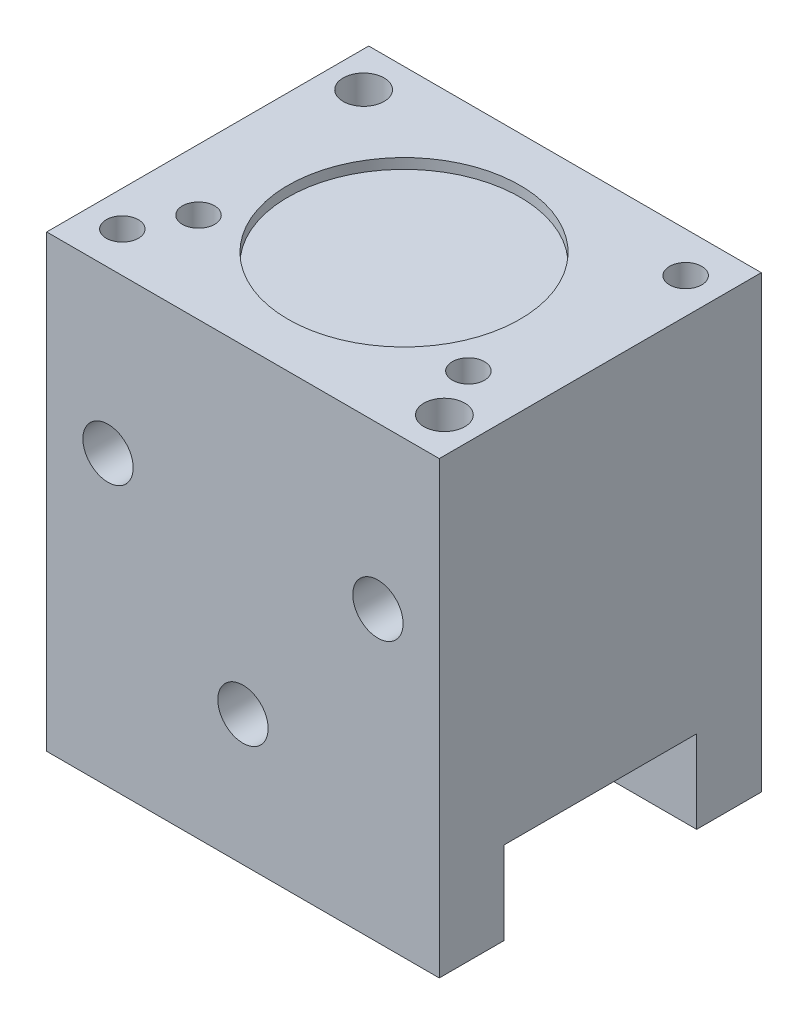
ISO-10303-21;
HEADER;
FILE_DESCRIPTION(('STEP AP214'),'2;1');
FILE_NAME('part.step','',(''),(''),'','','');
FILE_SCHEMA(('AUTOMOTIVE_DESIGN { 1 0 10303 214 1 1 1 1 }'));
ENDSEC;
DATA;
#1=APPLICATION_CONTEXT('core data for automotive mechanical design processes');
#2=APPLICATION_PROTOCOL_DEFINITION('international standard','automotive_design',2000,#1);
#3=PRODUCT_CONTEXT('',#1,'mechanical');
#4=PRODUCT('Part','Part','',(#3));
#5=PRODUCT_RELATED_PRODUCT_CATEGORY('part','',(#4));
#6=PRODUCT_DEFINITION_FORMATION('','',#4);
#7=PRODUCT_DEFINITION_CONTEXT('part definition',#1,'design');
#8=PRODUCT_DEFINITION('design','',#6,#7);
#9=PRODUCT_DEFINITION_SHAPE('','',#8);
#10=(LENGTH_UNIT() NAMED_UNIT(*) SI_UNIT(.MILLI.,.METRE.));
#11=(NAMED_UNIT(*) PLANE_ANGLE_UNIT() SI_UNIT($,.RADIAN.));
#12=(NAMED_UNIT(*) SI_UNIT($,.STERADIAN.) SOLID_ANGLE_UNIT());
#13=UNCERTAINTY_MEASURE_WITH_UNIT(LENGTH_MEASURE(1.E-05),#10,'distance_accuracy_value','');
#14=(GEOMETRIC_REPRESENTATION_CONTEXT(3) GLOBAL_UNCERTAINTY_ASSIGNED_CONTEXT((#13)) GLOBAL_UNIT_ASSIGNED_CONTEXT((#10,
#11,#12)) REPRESENTATION_CONTEXT('',''));
#15=CARTESIAN_POINT('',(0.,0.,0.));
#16=DIRECTION('',(0.,0.,1.));
#17=DIRECTION('',(1.,0.,0.));
#18=AXIS2_PLACEMENT_3D('',#15,#16,#17);
#19=CARTESIAN_POINT('',(-9.7536,-11.176,8.001));
#20=DIRECTION('',(0.,1.,0.));
#21=DIRECTION('',(0.,0.,1.));
#22=AXIS2_PLACEMENT_3D('',#19,#20,#21);
#23=PLANE('',#22);
#24=CARTESIAN_POINT('',(5.842,-11.176,-6.1722));
#25=DIRECTION('',(0.,-1.,0.));
#26=DIRECTION('',(0.,0.,-1.));
#27=AXIS2_PLACEMENT_3D('',#24,#25,#26);
#28=CIRCLE('',#27,0.888999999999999);
#29=CARTESIAN_POINT('',(5.842,-11.176,-7.0612));
#30=VERTEX_POINT('',#29);
#31=EDGE_CURVE('E176',#30,#30,#28,.T.);
#32=ORIENTED_EDGE('',*,*,#31,.F.);
#33=EDGE_LOOP('',(#32));
#34=FACE_BOUND('',#33,.T.);
#35=CARTESIAN_POINT('',(-5.842,-11.176,-6.1722));
#36=DIRECTION('',(0.,-1.,0.));
#37=DIRECTION('',(0.,0.,-1.));
#38=AXIS2_PLACEMENT_3D('',#35,#36,#37);
#39=CIRCLE('',#38,0.888999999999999);
#40=CARTESIAN_POINT('',(-5.842,-11.176,-7.0612));
#41=VERTEX_POINT('',#40);
#42=EDGE_CURVE('E182',#41,#41,#39,.T.);
#43=ORIENTED_EDGE('',*,*,#42,.F.);
#44=EDGE_LOOP('',(#43));
#45=FACE_BOUND('',#44,.T.);
#46=DIRECTION('',(0.,0.,-1.));
#47=VECTOR('',#46,1.);
#48=CARTESIAN_POINT('',(9.7536,-11.176,-8.001));
#49=LINE('',#48,#47);
#50=CARTESIAN_POINT('',(9.7536,-11.176,-4.7879));
#51=VERTEX_POINT('',#50);
#52=CARTESIAN_POINT('',(9.7536,-11.176,-8.001));
#53=VERTEX_POINT('',#52);
#54=EDGE_CURVE('E278',#51,#53,#49,.T.);
#55=ORIENTED_EDGE('',*,*,#54,.F.);
#56=DIRECTION('',(1.,0.,0.));
#57=VECTOR('',#56,1.);
#58=CARTESIAN_POINT('',(9.7536,-11.176,-4.7879));
#59=LINE('',#58,#57);
#60=CARTESIAN_POINT('',(-9.7536,-11.176,-4.7879));
#61=VERTEX_POINT('',#60);
#62=EDGE_CURVE('E389',#61,#51,#59,.T.);
#63=ORIENTED_EDGE('',*,*,#62,.F.);
#64=DIRECTION('',(0.,0.,1.));
#65=VECTOR('',#64,1.);
#66=CARTESIAN_POINT('',(-9.7536,-11.176,-8.001));
#67=LINE('',#66,#65);
#68=CARTESIAN_POINT('',(-9.7536,-11.176,-8.001));
#69=VERTEX_POINT('',#68);
#70=EDGE_CURVE('E266',#69,#61,#67,.T.);
#71=ORIENTED_EDGE('',*,*,#70,.F.);
#72=DIRECTION('',(-1.,0.,0.));
#73=VECTOR('',#72,1.);
#74=CARTESIAN_POINT('',(-9.7536,-11.176,-8.001));
#75=LINE('',#74,#73);
#76=EDGE_CURVE('E281',#53,#69,#75,.T.);
#77=ORIENTED_EDGE('',*,*,#76,.F.);
#78=EDGE_LOOP('',(#55,#63,#71,#77));
#79=FACE_BOUND('',#78,.T.);
#80=ADVANCED_FACE('F37',(#34,#45,#79),#23,.F.);
#81=CARTESIAN_POINT('',(-6.7056,4.3434,3.5052));
#82=DIRECTION('',(0.,1.,0.));
#83=DIRECTION('',(0.,0.,1.));
#84=AXIS2_PLACEMENT_3D('',#81,#82,#83);
#85=CONICAL_SURFACE('',#84,0.799999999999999,1.02974425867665);
#86=CARTESIAN_POINT('',(-6.7056,4.3434,3.5052));
#87=DIRECTION('',(0.,1.,0.));
#88=DIRECTION('',(0.,0.,1.));
#89=AXIS2_PLACEMENT_3D('',#86,#87,#88);
#90=CIRCLE('',#89,0.799999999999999);
#91=CARTESIAN_POINT('',(-7.14983129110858,4.3434,2.83987409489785));
#92=VERTEX_POINT('',#91);
#93=CARTESIAN_POINT('',(-7.14983129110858,4.3434,4.17052590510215));
#94=VERTEX_POINT('',#93);
#95=EDGE_CURVE('E481',#92,#94,#90,.T.);
#96=ORIENTED_EDGE('',*,*,#95,.T.);
#97=CARTESIAN_POINT('',(-6.99233491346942,4.3916688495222,4.33752747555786));
#98=CARTESIAN_POINT('',(-7.02395346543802,4.38418070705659,4.31340574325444));
#99=CARTESIAN_POINT('',(-7.05305142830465,4.37605945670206,4.28657089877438));
#100=CARTESIAN_POINT('',(-7.10647136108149,4.35931531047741,4.22890140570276));
#101=CARTESIAN_POINT('',(-7.13081974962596,4.35069555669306,4.19809056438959));
#102=CARTESIAN_POINT('',(-7.18607113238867,4.32950888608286,4.11807609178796));
#103=CARTESIAN_POINT('',(-7.21449278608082,4.31703787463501,4.0671545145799));
#104=CARTESIAN_POINT('',(-7.26313389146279,4.29409771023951,3.9609026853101));
#105=CARTESIAN_POINT('',(-7.28331631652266,4.2836377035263,3.90555383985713));
#106=CARTESIAN_POINT('',(-7.31586147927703,4.26606885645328,3.79088525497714));
#107=CARTESIAN_POINT('',(-7.32806443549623,4.25902917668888,3.73150920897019));
#108=CARTESIAN_POINT('',(-7.3438500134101,4.24981288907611,3.61140738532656));
#109=CARTESIAN_POINT('',(-7.34745643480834,4.24762285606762,3.55068580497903));
#110=CARTESIAN_POINT('',(-7.34599248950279,4.24849871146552,3.42726261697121));
#111=CARTESIAN_POINT('',(-7.34061520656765,4.25175051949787,3.36456579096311));
#112=CARTESIAN_POINT('',(-7.32070514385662,4.26324349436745,3.24090105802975));
#113=CARTESIAN_POINT('',(-7.3061396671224,4.27150247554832,3.17994014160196));
#114=CARTESIAN_POINT('',(-7.26781742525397,4.29163917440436,3.0611847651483));
#115=CARTESIAN_POINT('',(-7.24400210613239,4.30353984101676,3.00341321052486));
#116=CARTESIAN_POINT('',(-7.18683958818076,4.32907505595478,2.89348334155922));
#117=CARTESIAN_POINT('',(-7.15355127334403,4.3426986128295,2.84129300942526));
#118=CARTESIAN_POINT('',(-7.09694838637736,4.36230959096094,2.77110282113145));
#119=CARTESIAN_POINT('',(-7.07783420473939,4.36848066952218,2.74975632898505));
#120=CARTESIAN_POINT('',(-7.03704386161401,4.38044349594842,2.70939211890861));
#121=CARTESIAN_POINT('',(-7.01535811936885,4.38623369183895,2.69038368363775));
#122=CARTESIAN_POINT('',(-6.99233491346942,4.3916688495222,2.67287252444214));
#123=B_SPLINE_CURVE_WITH_KNOTS('',3,(#97,#98,#99,#100,#101,#102,#103,#104,#105,#106,#107,#108,
#109,#110,#111,#112,#113,#114,#115,#116,#117,#118,#119,#120,#121,#122),.UNSPECIFIED.,.F.,.F.,(4,
2,2,2,2,2,2,2,2,2,2,2,4),(0.,0.120884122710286,0.2410753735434,0.419084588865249,
0.597885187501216,0.780164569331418,0.961938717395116,1.15005075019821,1.33883600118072,
1.52883631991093,1.71768047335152,1.805431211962,1.89351980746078),.UNSPECIFIED.);
#124=EDGE_CURVE('E11',#94,#92,#123,.T.);
#125=ORIENTED_EDGE('',*,*,#124,.T.);
#126=EDGE_LOOP('',(#96,#125));
#127=FACE_BOUND('',#126,.T.);
#128=ADVANCED_FACE('F225',(#127),#85,.F.);
#129=CARTESIAN_POINT('',(6.7056,4.3434,3.5052));
#130=DIRECTION('',(0.,1.,0.));
#131=DIRECTION('',(0.,0.,1.));
#132=AXIS2_PLACEMENT_3D('',#129,#130,#131);
#133=CONICAL_SURFACE('',#132,0.799999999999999,1.02974425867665);
#134=CARTESIAN_POINT('',(6.7056,4.3434,3.5052));
#135=DIRECTION('',(0.,1.,0.));
#136=DIRECTION('',(0.,0.,1.));
#137=AXIS2_PLACEMENT_3D('',#134,#135,#136);
#138=CIRCLE('',#137,0.799999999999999);
#139=CARTESIAN_POINT('',(6.26136870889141,4.3434,2.83987409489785));
#140=VERTEX_POINT('',#139);
#141=CARTESIAN_POINT('',(6.26136870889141,4.3434,4.17052590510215));
#142=VERTEX_POINT('',#141);
#143=EDGE_CURVE('E490',#140,#142,#138,.T.);
#144=ORIENTED_EDGE('',*,*,#143,.T.);
#145=CARTESIAN_POINT('',(6.41886508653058,4.3916688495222,4.33752747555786));
#146=CARTESIAN_POINT('',(6.38724653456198,4.38418070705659,4.31340574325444));
#147=CARTESIAN_POINT('',(6.35814857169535,4.37605945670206,4.28657089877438));
#148=CARTESIAN_POINT('',(6.30472863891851,4.35931531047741,4.22890140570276));
#149=CARTESIAN_POINT('',(6.28038025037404,4.35069555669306,4.19809056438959));
#150=CARTESIAN_POINT('',(6.22512886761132,4.32950888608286,4.11807609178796));
#151=CARTESIAN_POINT('',(6.19670721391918,4.31703787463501,4.0671545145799));
#152=CARTESIAN_POINT('',(6.14806610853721,4.29409771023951,3.9609026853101));
#153=CARTESIAN_POINT('',(6.12788368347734,4.2836377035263,3.90555383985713));
#154=CARTESIAN_POINT('',(6.09533852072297,4.26606885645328,3.79088525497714));
#155=CARTESIAN_POINT('',(6.08313556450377,4.25902917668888,3.73150920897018));
#156=CARTESIAN_POINT('',(6.0673499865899,4.24981288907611,3.61140738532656));
#157=CARTESIAN_POINT('',(6.06374356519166,4.24762285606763,3.55068580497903));
#158=CARTESIAN_POINT('',(6.06520751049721,4.24849871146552,3.42726261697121));
#159=CARTESIAN_POINT('',(6.07058479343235,4.25175051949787,3.3645657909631));
#160=CARTESIAN_POINT('',(6.09049485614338,4.26324349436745,3.24090105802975));
#161=CARTESIAN_POINT('',(6.1050603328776,4.27150247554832,3.17994014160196));
#162=CARTESIAN_POINT('',(6.14338257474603,4.29163917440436,3.0611847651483));
#163=CARTESIAN_POINT('',(6.16719789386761,4.30353984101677,3.00341321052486));
#164=CARTESIAN_POINT('',(6.22436041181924,4.32907505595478,2.89348334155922));
#165=CARTESIAN_POINT('',(6.25764872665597,4.3426986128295,2.84129300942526));
#166=CARTESIAN_POINT('',(6.31425161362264,4.36230959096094,2.77110282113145));
#167=CARTESIAN_POINT('',(6.33336579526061,4.36848066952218,2.74975632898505));
#168=CARTESIAN_POINT('',(6.37415613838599,4.38044349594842,2.70939211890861));
#169=CARTESIAN_POINT('',(6.39584188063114,4.38623369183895,2.69038368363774));
#170=CARTESIAN_POINT('',(6.41886508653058,4.3916688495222,2.67287252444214));
#171=B_SPLINE_CURVE_WITH_KNOTS('',3,(#145,#146,#147,#148,#149,#150,#151,#152,#153,#154,#155,
#156,#157,#158,#159,#160,#161,#162,#163,#164,#165,#166,#167,#168,#169,#170),.UNSPECIFIED.,.F.,
.F.,(4,2,2,2,2,2,2,2,2,2,2,2,4),(0.,0.120884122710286,0.2410753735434,0.419084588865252,
0.597885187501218,0.780164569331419,0.961938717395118,1.15005075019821,1.33883600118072,
1.52883631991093,1.71768047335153,1.805431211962,1.89351980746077),.UNSPECIFIED.);
#172=EDGE_CURVE('E303',#142,#140,#171,.T.);
#173=ORIENTED_EDGE('',*,*,#172,.T.);
#174=EDGE_LOOP('',(#144,#173));
#175=FACE_BOUND('',#174,.T.);
#176=ADVANCED_FACE('F232',(#175),#133,.F.);
#177=CARTESIAN_POINT('',(-9.7536,11.176,-8.001));
#178=DIRECTION('',(1.,0.,0.));
#179=DIRECTION('',(0.,0.,-1.));
#180=AXIS2_PLACEMENT_3D('',#177,#178,#179);
#181=PLANE('',#180);
#182=ORIENTED_EDGE('',*,*,#70,.T.);
#183=DIRECTION('',(0.,-1.,0.));
#184=VECTOR('',#183,1.);
#185=CARTESIAN_POINT('',(-9.7536,-7.0612,-4.7879));
#186=LINE('',#185,#184);
#187=CARTESIAN_POINT('',(-9.7536,-7.0612,-4.7879));
#188=VERTEX_POINT('',#187);
#189=EDGE_CURVE('E392',#188,#61,#186,.T.);
#190=ORIENTED_EDGE('',*,*,#189,.F.);
#191=DIRECTION('',(0.,0.,-1.));
#192=VECTOR('',#191,1.);
#193=CARTESIAN_POINT('',(-9.7536,-7.0612,4.7879));
#194=LINE('',#193,#192);
#195=CARTESIAN_POINT('',(-9.7536,-7.0612,4.7879));
#196=VERTEX_POINT('',#195);
#197=EDGE_CURVE('E393',#196,#188,#194,.T.);
#198=ORIENTED_EDGE('',*,*,#197,.F.);
#199=DIRECTION('',(0.,-1.,0.));
#200=VECTOR('',#199,1.);
#201=CARTESIAN_POINT('',(-9.7536,-7.0612,4.7879));
#202=LINE('',#201,#200);
#203=CARTESIAN_POINT('',(-9.7536,-11.176,4.7879));
#204=VERTEX_POINT('',#203);
#205=EDGE_CURVE('E396',#196,#204,#202,.T.);
#206=ORIENTED_EDGE('',*,*,#205,.T.);
#207=CARTESIAN_POINT('',(-9.7536,-11.176,8.001));
#208=VERTEX_POINT('',#207);
#209=EDGE_CURVE('E258',#204,#208,#67,.T.);
#210=ORIENTED_EDGE('',*,*,#209,.T.);
#211=DIRECTION('',(0.,-1.,0.));
#212=VECTOR('',#211,1.);
#213=CARTESIAN_POINT('',(-9.7536,11.176,8.001));
#214=LINE('',#213,#212);
#215=CARTESIAN_POINT('',(-9.7536,11.176,8.001));
#216=VERTEX_POINT('',#215);
#217=EDGE_CURVE('E293',#216,#208,#214,.T.);
#218=ORIENTED_EDGE('',*,*,#217,.F.);
#219=DIRECTION('',(0.,0.,1.));
#220=VECTOR('',#219,1.);
#221=CARTESIAN_POINT('',(-9.7536,11.176,-8.001));
#222=LINE('',#221,#220);
#223=CARTESIAN_POINT('',(-9.7536,11.176,-8.001));
#224=VERTEX_POINT('',#223);
#225=EDGE_CURVE('E283',#224,#216,#222,.T.);
#226=ORIENTED_EDGE('',*,*,#225,.F.);
#227=DIRECTION('',(0.,-1.,0.));
#228=VECTOR('',#227,1.);
#229=CARTESIAN_POINT('',(-9.7536,11.176,-8.001));
#230=LINE('',#229,#228);
#231=EDGE_CURVE('E284',#224,#69,#230,.T.);
#232=ORIENTED_EDGE('',*,*,#231,.T.);
#233=EDGE_LOOP('',(#182,#190,#198,#206,#210,#218,#226,#232));
#234=FACE_BOUND('',#233,.T.);
#235=ADVANCED_FACE('F39',(#234),#181,.F.);
#236=CARTESIAN_POINT('',(-9.7536,11.176,8.001));
#237=DIRECTION('',(0.,0.,-1.));
#238=DIRECTION('',(-1.,0.,0.));
#239=AXIS2_PLACEMENT_3D('',#236,#237,#238);
#240=PLANE('',#239);
#241=CARTESIAN_POINT('',(0.,-4.699,8.001));
#242=DIRECTION('',(0.,0.,1.));
#243=DIRECTION('',(1.,0.,0.));
#244=AXIS2_PLACEMENT_3D('',#241,#242,#243);
#245=CIRCLE('',#244,1.24999999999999);
#246=CARTESIAN_POINT('',(1.24999999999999,-4.699,8.001));
#247=VERTEX_POINT('',#246);
#248=EDGE_CURVE('E398',#247,#247,#245,.T.);
#249=ORIENTED_EDGE('',*,*,#248,.F.);
#250=EDGE_LOOP('',(#249));
#251=FACE_BOUND('',#250,.T.);
#252=CARTESIAN_POINT('',(-6.7056,3.175,8.001));
#253=DIRECTION('',(0.,0.,1.));
#254=DIRECTION('',(1.,0.,0.));
#255=AXIS2_PLACEMENT_3D('',#252,#253,#254);
#256=CIRCLE('',#255,1.25);
#257=CARTESIAN_POINT('',(-5.4556,3.175,8.001));
#258=VERTEX_POINT('',#257);
#259=EDGE_CURVE('E410',#258,#258,#256,.T.);
#260=ORIENTED_EDGE('',*,*,#259,.F.);
#261=EDGE_LOOP('',(#260));
#262=FACE_BOUND('',#261,.T.);
#263=CARTESIAN_POINT('',(6.7056,3.175,8.001));
#264=DIRECTION('',(0.,0.,1.));
#265=DIRECTION('',(1.,0.,0.));
#266=AXIS2_PLACEMENT_3D('',#263,#264,#265);
#267=CIRCLE('',#266,1.25);
#268=CARTESIAN_POINT('',(7.9556,3.175,8.001));
#269=VERTEX_POINT('',#268);
#270=EDGE_CURVE('E332',#269,#269,#267,.T.);
#271=ORIENTED_EDGE('',*,*,#270,.F.);
#272=EDGE_LOOP('',(#271));
#273=FACE_BOUND('',#272,.T.);
#274=DIRECTION('',(1.,0.,0.));
#275=VECTOR('',#274,1.);
#276=CARTESIAN_POINT('',(-9.7536,-11.176,8.001));
#277=LINE('',#276,#275);
#278=CARTESIAN_POINT('',(9.7536,-11.176,8.001));
#279=VERTEX_POINT('',#278);
#280=EDGE_CURVE('E261',#208,#279,#277,.T.);
#281=ORIENTED_EDGE('',*,*,#280,.T.);
#282=DIRECTION('',(0.,-1.,0.));
#283=VECTOR('',#282,1.);
#284=CARTESIAN_POINT('',(9.7536,11.176,8.001));
#285=LINE('',#284,#283);
#286=CARTESIAN_POINT('',(9.7536,11.176,8.001));
#287=VERTEX_POINT('',#286);
#288=EDGE_CURVE('E290',#287,#279,#285,.T.);
#289=ORIENTED_EDGE('',*,*,#288,.F.);
#290=DIRECTION('',(1.,0.,0.));
#291=VECTOR('',#290,1.);
#292=CARTESIAN_POINT('',(-9.7536,11.176,8.001));
#293=LINE('',#292,#291);
#294=EDGE_CURVE('E368',#216,#287,#293,.T.);
#295=ORIENTED_EDGE('',*,*,#294,.F.);
#296=ORIENTED_EDGE('',*,*,#217,.T.);
#297=EDGE_LOOP('',(#281,#289,#295,#296));
#298=FACE_BOUND('',#297,.T.);
#299=ADVANCED_FACE('F380',(#251,#262,#273,#298),#240,.F.);
#300=CARTESIAN_POINT('',(9.7536,11.176,-8.001));
#301=DIRECTION('',(-1.,0.,0.));
#302=DIRECTION('',(0.,0.,1.));
#303=AXIS2_PLACEMENT_3D('',#300,#301,#302);
#304=PLANE('',#303);
#305=DIRECTION('',(0.,0.,1.));
#306=VECTOR('',#305,1.);
#307=CARTESIAN_POINT('',(9.7536,-7.0612,4.7879));
#308=LINE('',#307,#306);
#309=CARTESIAN_POINT('',(9.7536,-7.0612,-4.7879));
#310=VERTEX_POINT('',#309);
#311=CARTESIAN_POINT('',(9.7536,-7.0612,4.7879));
#312=VERTEX_POINT('',#311);
#313=EDGE_CURVE('E199',#310,#312,#308,.T.);
#314=ORIENTED_EDGE('',*,*,#313,.F.);
#315=DIRECTION('',(0.,-1.,0.));
#316=VECTOR('',#315,1.);
#317=CARTESIAN_POINT('',(9.7536,-7.0612,-4.7879));
#318=LINE('',#317,#316);
#319=EDGE_CURVE('E395',#310,#51,#318,.T.);
#320=ORIENTED_EDGE('',*,*,#319,.T.);
#321=ORIENTED_EDGE('',*,*,#54,.T.);
#322=DIRECTION('',(0.,-1.,0.));
#323=VECTOR('',#322,1.);
#324=CARTESIAN_POINT('',(9.7536,11.176,-8.001));
#325=LINE('',#324,#323);
#326=CARTESIAN_POINT('',(9.7536,11.176,-8.001));
#327=VERTEX_POINT('',#326);
#328=EDGE_CURVE('E287',#327,#53,#325,.T.);
#329=ORIENTED_EDGE('',*,*,#328,.F.);
#330=DIRECTION('',(0.,0.,-1.));
#331=VECTOR('',#330,1.);
#332=CARTESIAN_POINT('',(9.7536,11.176,-8.001));
#333=LINE('',#332,#331);
#334=EDGE_CURVE('E369',#287,#327,#333,.T.);
#335=ORIENTED_EDGE('',*,*,#334,.F.);
#336=ORIENTED_EDGE('',*,*,#288,.T.);
#337=CARTESIAN_POINT('',(9.7536,-11.176,4.7879));
#338=VERTEX_POINT('',#337);
#339=EDGE_CURVE('E279',#279,#338,#49,.T.);
#340=ORIENTED_EDGE('',*,*,#339,.T.);
#341=DIRECTION('',(0.,-1.,0.));
#342=VECTOR('',#341,1.);
#343=CARTESIAN_POINT('',(9.7536,-7.0612,4.7879));
#344=LINE('',#343,#342);
#345=EDGE_CURVE('E57',#312,#338,#344,.T.);
#346=ORIENTED_EDGE('',*,*,#345,.F.);
#347=EDGE_LOOP('',(#314,#320,#321,#329,#335,#336,#340,#346));
#348=FACE_BOUND('',#347,.T.);
#349=ADVANCED_FACE('F384',(#348),#304,.F.);
#350=CARTESIAN_POINT('',(-9.7536,11.176,-8.001));
#351=DIRECTION('',(0.,0.,1.));
#352=DIRECTION('',(1.,0.,0.));
#353=AXIS2_PLACEMENT_3D('',#350,#351,#352);
#354=PLANE('',#353);
#355=ORIENTED_EDGE('',*,*,#76,.T.);
#356=ORIENTED_EDGE('',*,*,#231,.F.);
#357=DIRECTION('',(-1.,0.,0.));
#358=VECTOR('',#357,1.);
#359=CARTESIAN_POINT('',(-9.7536,11.176,-8.001));
#360=LINE('',#359,#358);
#361=EDGE_CURVE('E275',#327,#224,#360,.T.);
#362=ORIENTED_EDGE('',*,*,#361,.F.);
#363=ORIENTED_EDGE('',*,*,#328,.T.);
#364=EDGE_LOOP('',(#355,#356,#362,#363));
#365=FACE_BOUND('',#364,.T.);
#366=ADVANCED_FACE('F250',(#365),#354,.F.);
#367=CARTESIAN_POINT('',(-9.7536,11.176,8.001));
#368=DIRECTION('',(0.,1.,0.));
#369=DIRECTION('',(0.,0.,1.));
#370=AXIS2_PLACEMENT_3D('',#367,#368,#369);
#371=PLANE('',#370);
#372=CARTESIAN_POINT('',(0.,11.176,0.));
#373=DIRECTION('',(0.,1.,0.));
#374=DIRECTION('',(0.,0.,1.));
#375=AXIS2_PLACEMENT_3D('',#372,#373,#374);
#376=CIRCLE('',#375,5.7658);
#377=CARTESIAN_POINT('',(0.,11.176,5.7658));
#378=VERTEX_POINT('',#377);
#379=EDGE_CURVE('E467',#378,#378,#376,.T.);
#380=ORIENTED_EDGE('',*,*,#379,.F.);
#381=EDGE_LOOP('',(#380));
#382=FACE_BOUND('',#381,.T.);
#383=CARTESIAN_POINT('',(-8.001,11.176,-5.9944));
#384=DIRECTION('',(0.,1.,0.));
#385=DIRECTION('',(0.,0.,1.));
#386=AXIS2_PLACEMENT_3D('',#383,#384,#385);
#387=CIRCLE('',#386,1.016);
#388=CARTESIAN_POINT('',(-8.001,11.176,-4.9784));
#389=VERTEX_POINT('',#388);
#390=EDGE_CURVE('E469',#389,#389,#387,.T.);
#391=ORIENTED_EDGE('',*,*,#390,.F.);
#392=EDGE_LOOP('',(#391));
#393=FACE_BOUND('',#392,.T.);
#394=CARTESIAN_POINT('',(8.001,11.176,5.9944));
#395=DIRECTION('',(0.,1.,0.));
#396=DIRECTION('',(0.,0.,1.));
#397=AXIS2_PLACEMENT_3D('',#394,#395,#396);
#398=CIRCLE('',#397,1.016);
#399=CARTESIAN_POINT('',(8.001,11.176,7.0104));
#400=VERTEX_POINT('',#399);
#401=EDGE_CURVE('E475',#400,#400,#398,.T.);
#402=ORIENTED_EDGE('',*,*,#401,.F.);
#403=EDGE_LOOP('',(#402));
#404=FACE_BOUND('',#403,.T.);
#405=CARTESIAN_POINT('',(-6.7056,11.176,3.5052));
#406=DIRECTION('',(0.,1.,0.));
#407=DIRECTION('',(0.,0.,1.));
#408=AXIS2_PLACEMENT_3D('',#405,#406,#407);
#409=CIRCLE('',#408,0.79999999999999);
#410=CARTESIAN_POINT('',(-6.7056,11.176,4.30519999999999));
#411=VERTEX_POINT('',#410);
#412=EDGE_CURVE('E487',#411,#411,#409,.T.);
#413=ORIENTED_EDGE('',*,*,#412,.F.);
#414=EDGE_LOOP('',(#413));
#415=FACE_BOUND('',#414,.T.);
#416=CARTESIAN_POINT('',(6.7056,11.176,3.5052));
#417=DIRECTION('',(0.,1.,0.));
#418=DIRECTION('',(0.,0.,1.));
#419=AXIS2_PLACEMENT_3D('',#416,#417,#418);
#420=CIRCLE('',#419,0.79999999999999);
#421=CARTESIAN_POINT('',(6.7056,11.176,4.30519999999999));
#422=VERTEX_POINT('',#421);
#423=EDGE_CURVE('E494',#422,#422,#420,.T.);
#424=ORIENTED_EDGE('',*,*,#423,.F.);
#425=EDGE_LOOP('',(#424));
#426=FACE_BOUND('',#425,.T.);
#427=CARTESIAN_POINT('',(-8.001,11.176,5.9944));
#428=DIRECTION('',(0.,1.,0.));
#429=DIRECTION('',(0.,0.,1.));
#430=AXIS2_PLACEMENT_3D('',#427,#428,#429);
#431=CIRCLE('',#430,0.799999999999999);
#432=CARTESIAN_POINT('',(-8.001,11.176,6.7944));
#433=VERTEX_POINT('',#432);
#434=EDGE_CURVE('E359',#433,#433,#431,.T.);
#435=ORIENTED_EDGE('',*,*,#434,.F.);
#436=EDGE_LOOP('',(#435));
#437=FACE_BOUND('',#436,.T.);
#438=CARTESIAN_POINT('',(8.001,11.176,-5.9944));
#439=DIRECTION('',(0.,1.,0.));
#440=DIRECTION('',(0.,0.,1.));
#441=AXIS2_PLACEMENT_3D('',#438,#439,#440);
#442=CIRCLE('',#441,0.799999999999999);
#443=CARTESIAN_POINT('',(8.001,11.176,-5.1944));
#444=VERTEX_POINT('',#443);
#445=EDGE_CURVE('E267',#444,#444,#442,.T.);
#446=ORIENTED_EDGE('',*,*,#445,.F.);
#447=EDGE_LOOP('',(#446));
#448=FACE_BOUND('',#447,.T.);
#449=ORIENTED_EDGE('',*,*,#225,.T.);
#450=ORIENTED_EDGE('',*,*,#294,.T.);
#451=ORIENTED_EDGE('',*,*,#334,.T.);
#452=ORIENTED_EDGE('',*,*,#361,.T.);
#453=EDGE_LOOP('',(#449,#450,#451,#452));
#454=FACE_BOUND('',#453,.T.);
#455=ADVANCED_FACE('F241',(#382,#393,#404,#415,#426,#437,#448,#454),#371,.T.);
#456=CARTESIAN_POINT('',(-5.842,-11.176,6.1722));
#457=DIRECTION('',(0.,-1.,0.));
#458=DIRECTION('',(0.,0.,-1.));
#459=AXIS2_PLACEMENT_3D('',#456,#457,#458);
#460=CIRCLE('',#459,0.888999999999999);
#461=CARTESIAN_POINT('',(-5.842,-11.176,5.2832));
#462=VERTEX_POINT('',#461);
#463=EDGE_CURVE('E162',#462,#462,#460,.T.);
#464=ORIENTED_EDGE('',*,*,#463,.F.);
#465=EDGE_LOOP('',(#464));
#466=FACE_BOUND('',#465,.T.);
#467=CARTESIAN_POINT('',(5.842,-11.176,6.1722));
#468=DIRECTION('',(0.,-1.,0.));
#469=DIRECTION('',(0.,0.,-1.));
#470=AXIS2_PLACEMENT_3D('',#467,#468,#469);
#471=CIRCLE('',#470,0.888999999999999);
#472=CARTESIAN_POINT('',(5.842,-11.176,5.2832));
#473=VERTEX_POINT('',#472);
#474=EDGE_CURVE('E170',#473,#473,#471,.T.);
#475=ORIENTED_EDGE('',*,*,#474,.F.);
#476=EDGE_LOOP('',(#475));
#477=FACE_BOUND('',#476,.T.);
#478=ORIENTED_EDGE('',*,*,#209,.F.);
#479=DIRECTION('',(-1.,0.,0.));
#480=VECTOR('',#479,1.);
#481=CARTESIAN_POINT('',(9.7536,-11.176,4.7879));
#482=LINE('',#481,#480);
#483=EDGE_CURVE('E198',#338,#204,#482,.T.);
#484=ORIENTED_EDGE('',*,*,#483,.F.);
#485=ORIENTED_EDGE('',*,*,#339,.F.);
#486=ORIENTED_EDGE('',*,*,#280,.F.);
#487=EDGE_LOOP('',(#478,#484,#485,#486));
#488=FACE_BOUND('',#487,.T.);
#489=ADVANCED_FACE('F228',(#466,#477,#488),#23,.F.);
#490=CARTESIAN_POINT('',(8.001,11.176,-5.9944));
#491=DIRECTION('',(0.,1.,0.));
#492=DIRECTION('',(0.,0.,1.));
#493=AXIS2_PLACEMENT_3D('',#490,#491,#492);
#494=CYLINDRICAL_SURFACE('',#493,0.799999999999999);
#495=CARTESIAN_POINT('',(8.001,4.3434,-5.9944));
#496=DIRECTION('',(0.,1.,0.));
#497=DIRECTION('',(0.,0.,1.));
#498=AXIS2_PLACEMENT_3D('',#495,#496,#497);
#499=CIRCLE('',#498,0.799999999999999);
#500=CARTESIAN_POINT('',(8.001,4.3434,-5.1944));
#501=VERTEX_POINT('',#500);
#502=EDGE_CURVE('E271',#501,#501,#499,.T.);
#503=ORIENTED_EDGE('',*,*,#502,.F.);
#504=EDGE_LOOP('',(#503));
#505=FACE_BOUND('',#504,.T.);
#506=ORIENTED_EDGE('',*,*,#445,.T.);
#507=EDGE_LOOP('',(#506));
#508=FACE_BOUND('',#507,.T.);
#509=ADVANCED_FACE('F240',(#505,#508),#494,.F.);
#510=CARTESIAN_POINT('',(8.001,4.3434,-5.9944));
#511=DIRECTION('',(0.,1.,0.));
#512=DIRECTION('',(0.,0.,1.));
#513=AXIS2_PLACEMENT_3D('',#510,#511,#512);
#514=CONICAL_SURFACE('',#513,0.799999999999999,1.02974425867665);
#515=CARTESIAN_POINT('',(8.001,3.86271150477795,-5.9944));
#516=VERTEX_POINT('',#515);
#517=VERTEX_LOOP('',#516);
#518=FACE_BOUND('',#517,.T.);
#519=ORIENTED_EDGE('',*,*,#502,.T.);
#520=EDGE_LOOP('',(#519));
#521=FACE_BOUND('',#520,.T.);
#522=ADVANCED_FACE('F247',(#518,#521),#514,.F.);
#523=CARTESIAN_POINT('',(-8.001,11.176,5.9944));
#524=DIRECTION('',(0.,1.,0.));
#525=DIRECTION('',(0.,0.,1.));
#526=AXIS2_PLACEMENT_3D('',#523,#524,#525);
#527=CYLINDRICAL_SURFACE('',#526,0.799999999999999);
#528=CARTESIAN_POINT('',(-8.001,4.3434,5.9944));
#529=DIRECTION('',(0.,1.,0.));
#530=DIRECTION('',(0.,0.,1.));
#531=AXIS2_PLACEMENT_3D('',#528,#529,#530);
#532=CIRCLE('',#531,0.799999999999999);
#533=CARTESIAN_POINT('',(-8.001,4.3434,6.7944));
#534=VERTEX_POINT('',#533);
#535=EDGE_CURVE('E362',#534,#534,#532,.T.);
#536=ORIENTED_EDGE('',*,*,#535,.F.);
#537=EDGE_LOOP('',(#536));
#538=FACE_BOUND('',#537,.T.);
#539=ORIENTED_EDGE('',*,*,#434,.T.);
#540=EDGE_LOOP('',(#539));
#541=FACE_BOUND('',#540,.T.);
#542=ADVANCED_FACE('F347',(#538,#541),#527,.F.);
#543=CARTESIAN_POINT('',(-8.001,4.3434,5.9944));
#544=DIRECTION('',(0.,1.,0.));
#545=DIRECTION('',(0.,0.,1.));
#546=AXIS2_PLACEMENT_3D('',#543,#544,#545);
#547=CONICAL_SURFACE('',#546,0.799999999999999,1.02974425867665);
#548=CARTESIAN_POINT('',(-8.001,3.86271150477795,5.9944));
#549=VERTEX_POINT('',#548);
#550=VERTEX_LOOP('',#549);
#551=FACE_BOUND('',#550,.T.);
#552=ORIENTED_EDGE('',*,*,#535,.T.);
#553=EDGE_LOOP('',(#552));
#554=FACE_BOUND('',#553,.T.);
#555=ADVANCED_FACE('F342',(#551,#554),#547,.F.);
#556=CARTESIAN_POINT('',(6.7056,11.176,3.5052));
#557=DIRECTION('',(0.,1.,0.));
#558=DIRECTION('',(0.,0.,1.));
#559=AXIS2_PLACEMENT_3D('',#556,#557,#558);
#560=CYLINDRICAL_SURFACE('',#559,0.799999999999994);
#561=ORIENTED_EDGE('',*,*,#143,.F.);
#562=CARTESIAN_POINT('',(6.26136870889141,4.3434,2.83987409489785));
#563=CARTESIAN_POINT('',(6.29429094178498,4.35595902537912,2.8178585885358));
#564=CARTESIAN_POINT('',(6.32919392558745,4.36759471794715,2.79812546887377));
#565=CARTESIAN_POINT('',(6.40235685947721,4.38824749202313,2.76380054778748));
#566=CARTESIAN_POINT('',(6.44063159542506,4.3972522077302,2.74923295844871));
#567=CARTESIAN_POINT('',(6.51978289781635,4.41177046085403,2.72598221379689));
#568=CARTESIAN_POINT('',(6.56066986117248,4.41726895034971,2.71732441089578));
#569=CARTESIAN_POINT('',(6.64352083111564,4.42414574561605,2.70652361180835));
#570=CARTESIAN_POINT('',(6.6854811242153,4.42553671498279,2.70436059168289));
#571=CARTESIAN_POINT('',(6.7659400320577,4.42414166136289,2.70654194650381));
#572=CARTESIAN_POINT('',(6.80445852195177,4.42166620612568,2.710402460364));
#573=CARTESIAN_POINT('',(6.88026710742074,4.41332549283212,2.72355098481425));
#574=CARTESIAN_POINT('',(6.91755401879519,4.40745207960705,2.73285205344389));
#575=CARTESIAN_POINT('',(6.98896781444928,4.39298812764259,2.75614821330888));
#576=CARTESIAN_POINT('',(7.02315053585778,4.38446951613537,2.77001957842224));
#577=CARTESIAN_POINT('',(7.08869054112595,4.36534338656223,2.801943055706));
#578=CARTESIAN_POINT('',(7.12005947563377,4.35474512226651,2.81997670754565));
#579=CARTESIAN_POINT('',(7.14983129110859,4.3434,2.83987409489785));
#580=B_SPLINE_CURVE_WITH_KNOTS('',3,(#562,#563,#564,#565,#566,#567,#568,#569,#570,#571,#572,
#573,#574,#575,#576,#577,#578,#579),.UNSPECIFIED.,.F.,.F.,(4,2,2,2,2,2,2,2,4),(0.,
0.12465569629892,0.249888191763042,0.375654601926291,0.501032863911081,0.616845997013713,
0.732938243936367,0.846115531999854,0.958800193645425),.UNSPECIFIED.);
#581=CARTESIAN_POINT('',(7.14983129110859,4.3434,2.83987409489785));
#582=VERTEX_POINT('',#581);
#583=EDGE_CURVE('E331',#140,#582,#580,.T.);
#584=ORIENTED_EDGE('',*,*,#583,.T.);
#585=CARTESIAN_POINT('',(7.14983129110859,4.3434,4.17052590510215));
#586=VERTEX_POINT('',#585);
#587=EDGE_CURVE('E491',#586,#582,#138,.T.);
#588=ORIENTED_EDGE('',*,*,#587,.F.);
#589=CARTESIAN_POINT('',(7.14983129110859,4.3434,4.17052590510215));
#590=CARTESIAN_POINT('',(7.11690905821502,4.35595902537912,4.19254141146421));
#591=CARTESIAN_POINT('',(7.08200607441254,4.36759471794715,4.21227453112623));
#592=CARTESIAN_POINT('',(7.00884314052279,4.38824749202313,4.24659945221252));
#593=CARTESIAN_POINT('',(6.97056840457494,4.3972522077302,4.26116704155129));
#594=CARTESIAN_POINT('',(6.89141710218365,4.41177046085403,4.28441778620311));
#595=CARTESIAN_POINT('',(6.85053013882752,4.41726895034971,4.29307558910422));
#596=CARTESIAN_POINT('',(6.76767916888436,4.42414574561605,4.30387638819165));
#597=CARTESIAN_POINT('',(6.7257188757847,4.42553671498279,4.30603940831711));
#598=CARTESIAN_POINT('',(6.6452599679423,4.42414166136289,4.30385805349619));
#599=CARTESIAN_POINT('',(6.60674147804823,4.42166620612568,4.299997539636));
#600=CARTESIAN_POINT('',(6.53093289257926,4.41332549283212,4.28684901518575));
#601=CARTESIAN_POINT('',(6.49364598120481,4.40745207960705,4.27754794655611));
#602=CARTESIAN_POINT('',(6.42223218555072,4.39298812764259,4.25425178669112));
#603=CARTESIAN_POINT('',(6.38804946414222,4.38446951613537,4.24038042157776));
#604=CARTESIAN_POINT('',(6.32250945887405,4.36534338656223,4.208456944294));
#605=CARTESIAN_POINT('',(6.29114052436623,4.35474512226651,4.19042329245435));
#606=CARTESIAN_POINT('',(6.26136870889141,4.3434,4.17052590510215));
#607=B_SPLINE_CURVE_WITH_KNOTS('',3,(#589,#590,#591,#592,#593,#594,#595,#596,#597,#598,#599,
#600,#601,#602,#603,#604,#605,#606),.UNSPECIFIED.,.F.,.F.,(4,2,2,2,2,2,2,2,4),(0.,
0.124655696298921,0.249888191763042,0.375654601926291,0.501032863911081,0.616845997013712,
0.732938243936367,0.846115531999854,0.958800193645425),.UNSPECIFIED.);
#608=EDGE_CURVE('E325',#586,#142,#607,.T.);
#609=ORIENTED_EDGE('',*,*,#608,.T.);
#610=EDGE_LOOP('',(#561,#584,#588,#609));
#611=FACE_BOUND('',#610,.T.);
#612=ORIENTED_EDGE('',*,*,#423,.T.);
#613=EDGE_LOOP('',(#612));
#614=FACE_BOUND('',#613,.T.);
#615=ADVANCED_FACE('F338',(#611,#614),#560,.F.);
#616=ORIENTED_EDGE('',*,*,#587,.T.);
#617=CARTESIAN_POINT('',(6.99233491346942,4.3916688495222,2.67287252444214));
#618=CARTESIAN_POINT('',(7.02395346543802,4.38418070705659,2.69699425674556));
#619=CARTESIAN_POINT('',(7.05305142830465,4.37605945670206,2.72382910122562));
#620=CARTESIAN_POINT('',(7.10647136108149,4.35931531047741,2.78149859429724));
#621=CARTESIAN_POINT('',(7.13081974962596,4.35069555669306,2.81230943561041));
#622=CARTESIAN_POINT('',(7.18607113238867,4.32950888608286,2.89232390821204));
#623=CARTESIAN_POINT('',(7.21449278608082,4.31703787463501,2.9432454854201));
#624=CARTESIAN_POINT('',(7.26313389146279,4.29409771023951,3.0494973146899));
#625=CARTESIAN_POINT('',(7.28331631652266,4.2836377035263,3.10484616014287));
#626=CARTESIAN_POINT('',(7.31586147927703,4.26606885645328,3.21951474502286));
#627=CARTESIAN_POINT('',(7.32806443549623,4.25902917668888,3.27889079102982));
#628=CARTESIAN_POINT('',(7.3438500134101,4.24981288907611,3.39899261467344));
#629=CARTESIAN_POINT('',(7.34745643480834,4.24762285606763,3.45971419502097));
#630=CARTESIAN_POINT('',(7.34599248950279,4.24849871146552,3.58313738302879));
#631=CARTESIAN_POINT('',(7.34061520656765,4.25175051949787,3.6458342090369));
#632=CARTESIAN_POINT('',(7.32070514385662,4.26324349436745,3.76949894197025));
#633=CARTESIAN_POINT('',(7.3061396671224,4.27150247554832,3.83045985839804));
#634=CARTESIAN_POINT('',(7.26781742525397,4.29163917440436,3.9492152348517));
#635=CARTESIAN_POINT('',(7.24400210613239,4.30353984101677,4.00698678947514));
#636=CARTESIAN_POINT('',(7.18683958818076,4.32907505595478,4.11691665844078));
#637=CARTESIAN_POINT('',(7.15355127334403,4.3426986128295,4.16910699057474));
#638=CARTESIAN_POINT('',(7.09694838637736,4.36230959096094,4.23929717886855));
#639=CARTESIAN_POINT('',(7.07783420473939,4.36848066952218,4.26064367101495));
#640=CARTESIAN_POINT('',(7.03704386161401,4.38044349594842,4.30100788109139));
#641=CARTESIAN_POINT('',(7.01535811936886,4.38623369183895,4.32001631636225));
#642=CARTESIAN_POINT('',(6.99233491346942,4.3916688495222,4.33752747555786));
#643=B_SPLINE_CURVE_WITH_KNOTS('',3,(#617,#618,#619,#620,#621,#622,#623,#624,#625,#626,#627,
#628,#629,#630,#631,#632,#633,#634,#635,#636,#637,#638,#639,#640,#641,#642),.UNSPECIFIED.,.F.,
.F.,(4,2,2,2,2,2,2,2,2,2,2,2,4),(0.,0.120884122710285,0.241075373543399,0.419084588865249,
0.597885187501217,0.780164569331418,0.961938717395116,1.15005075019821,1.33883600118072,
1.52883631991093,1.71768047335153,1.805431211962,1.89351980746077),.UNSPECIFIED.);
#644=EDGE_CURVE('E295',#582,#586,#643,.T.);
#645=ORIENTED_EDGE('',*,*,#644,.T.);
#646=EDGE_LOOP('',(#616,#645));
#647=FACE_BOUND('',#646,.T.);
#648=ADVANCED_FACE('F307',(#647),#133,.F.);
#649=CARTESIAN_POINT('',(-6.7056,11.176,3.5052));
#650=DIRECTION('',(0.,1.,0.));
#651=DIRECTION('',(0.,0.,1.));
#652=AXIS2_PLACEMENT_3D('',#649,#650,#651);
#653=CYLINDRICAL_SURFACE('',#652,0.799999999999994);
#654=ORIENTED_EDGE('',*,*,#95,.F.);
#655=CARTESIAN_POINT('',(-7.14983129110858,4.3434,2.83987409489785));
#656=CARTESIAN_POINT('',(-7.11690905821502,4.35595902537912,2.81785858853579));
#657=CARTESIAN_POINT('',(-7.08200607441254,4.36759471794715,2.79812546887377));
#658=CARTESIAN_POINT('',(-7.00884314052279,4.38824749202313,2.76380054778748));
#659=CARTESIAN_POINT('',(-6.97056840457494,4.3972522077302,2.74923295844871));
#660=CARTESIAN_POINT('',(-6.89141710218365,4.41177046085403,2.72598221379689));
#661=CARTESIAN_POINT('',(-6.85053013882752,4.41726895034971,2.71732441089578));
#662=CARTESIAN_POINT('',(-6.76767916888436,4.42414574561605,2.70652361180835));
#663=CARTESIAN_POINT('',(-6.7257188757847,4.42553671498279,2.70436059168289));
#664=CARTESIAN_POINT('',(-6.6452599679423,4.42414166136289,2.70654194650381));
#665=CARTESIAN_POINT('',(-6.60674147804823,4.42166620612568,2.710402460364));
#666=CARTESIAN_POINT('',(-6.53093289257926,4.41332549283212,2.72355098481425));
#667=CARTESIAN_POINT('',(-6.49364598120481,4.40745207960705,2.73285205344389));
#668=CARTESIAN_POINT('',(-6.42223218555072,4.39298812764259,2.75614821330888));
#669=CARTESIAN_POINT('',(-6.38804946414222,4.38446951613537,2.77001957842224));
#670=CARTESIAN_POINT('',(-6.32250945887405,4.36534338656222,2.801943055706));
#671=CARTESIAN_POINT('',(-6.29114052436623,4.35474512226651,2.81997670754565));
#672=CARTESIAN_POINT('',(-6.26136870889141,4.3434,2.83987409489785));
#673=B_SPLINE_CURVE_WITH_KNOTS('',3,(#655,#656,#657,#658,#659,#660,#661,#662,#663,#664,#665,
#666,#667,#668,#669,#670,#671,#672),.UNSPECIFIED.,.F.,.F.,(4,2,2,2,2,2,2,2,4),(0.,
0.12465569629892,0.249888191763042,0.37565460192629,0.50103286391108,0.616845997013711,
0.732938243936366,0.846115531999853,0.958800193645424),.UNSPECIFIED.);
#674=CARTESIAN_POINT('',(-6.26136870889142,4.3434,2.83987409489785));
#675=VERTEX_POINT('',#674);
#676=EDGE_CURVE('E417',#92,#675,#673,.T.);
#677=ORIENTED_EDGE('',*,*,#676,.T.);
#678=CARTESIAN_POINT('',(-6.26136870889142,4.3434,4.17052590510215));
#679=VERTEX_POINT('',#678);
#680=EDGE_CURVE('E484',#679,#675,#90,.T.);
#681=ORIENTED_EDGE('',*,*,#680,.F.);
#682=CARTESIAN_POINT('',(-6.26136870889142,4.3434,4.17052590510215));
#683=CARTESIAN_POINT('',(-6.29429094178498,4.35595902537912,4.19254141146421));
#684=CARTESIAN_POINT('',(-6.32919392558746,4.36759471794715,4.21227453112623));
#685=CARTESIAN_POINT('',(-6.40235685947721,4.38824749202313,4.24659945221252));
#686=CARTESIAN_POINT('',(-6.44063159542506,4.3972522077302,4.26116704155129));
#687=CARTESIAN_POINT('',(-6.51978289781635,4.41177046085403,4.28441778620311));
#688=CARTESIAN_POINT('',(-6.56066986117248,4.41726895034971,4.29307558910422));
#689=CARTESIAN_POINT('',(-6.64352083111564,4.42414574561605,4.30387638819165));
#690=CARTESIAN_POINT('',(-6.6854811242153,4.42553671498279,4.30603940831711));
#691=CARTESIAN_POINT('',(-6.7659400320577,4.42414166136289,4.30385805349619));
#692=CARTESIAN_POINT('',(-6.80445852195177,4.42166620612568,4.299997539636));
#693=CARTESIAN_POINT('',(-6.88026710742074,4.41332549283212,4.28684901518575));
#694=CARTESIAN_POINT('',(-6.91755401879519,4.40745207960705,4.27754794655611));
#695=CARTESIAN_POINT('',(-6.98896781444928,4.39298812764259,4.25425178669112));
#696=CARTESIAN_POINT('',(-7.02315053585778,4.38446951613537,4.24038042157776));
#697=CARTESIAN_POINT('',(-7.08869054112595,4.36534338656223,4.208456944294));
#698=CARTESIAN_POINT('',(-7.12005947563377,4.35474512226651,4.19042329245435));
#699=CARTESIAN_POINT('',(-7.14983129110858,4.3434,4.17052590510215));
#700=B_SPLINE_CURVE_WITH_KNOTS('',3,(#682,#683,#684,#685,#686,#687,#688,#689,#690,#691,#692,
#693,#694,#695,#696,#697,#698,#699),.UNSPECIFIED.,.F.,.F.,(4,2,2,2,2,2,2,2,4),(0.,
0.12465569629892,0.249888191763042,0.37565460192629,0.50103286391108,0.616845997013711,
0.732938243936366,0.846115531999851,0.958800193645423),.UNSPECIFIED.);
#701=EDGE_CURVE('E65',#679,#94,#700,.T.);
#702=ORIENTED_EDGE('',*,*,#701,.T.);
#703=EDGE_LOOP('',(#654,#677,#681,#702));
#704=FACE_BOUND('',#703,.T.);
#705=ORIENTED_EDGE('',*,*,#412,.T.);
#706=EDGE_LOOP('',(#705));
#707=FACE_BOUND('',#706,.T.);
#708=ADVANCED_FACE('F421',(#704,#707),#653,.F.);
#709=ORIENTED_EDGE('',*,*,#680,.T.);
#710=CARTESIAN_POINT('',(-6.41886508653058,4.3916688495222,2.67287252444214));
#711=CARTESIAN_POINT('',(-6.38724653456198,4.38418070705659,2.69699425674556));
#712=CARTESIAN_POINT('',(-6.35814857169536,4.37605945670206,2.72382910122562));
#713=CARTESIAN_POINT('',(-6.30472863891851,4.35931531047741,2.78149859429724));
#714=CARTESIAN_POINT('',(-6.28038025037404,4.35069555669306,2.81230943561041));
#715=CARTESIAN_POINT('',(-6.22512886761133,4.32950888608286,2.89232390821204));
#716=CARTESIAN_POINT('',(-6.19670721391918,4.31703787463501,2.9432454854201));
#717=CARTESIAN_POINT('',(-6.14806610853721,4.29409771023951,3.0494973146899));
#718=CARTESIAN_POINT('',(-6.12788368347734,4.2836377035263,3.10484616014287));
#719=CARTESIAN_POINT('',(-6.09533852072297,4.26606885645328,3.21951474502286));
#720=CARTESIAN_POINT('',(-6.08313556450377,4.25902917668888,3.27889079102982));
#721=CARTESIAN_POINT('',(-6.0673499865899,4.24981288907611,3.39899261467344));
#722=CARTESIAN_POINT('',(-6.06374356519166,4.24762285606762,3.45971419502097));
#723=CARTESIAN_POINT('',(-6.06520751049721,4.24849871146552,3.58313738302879));
#724=CARTESIAN_POINT('',(-6.07058479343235,4.25175051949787,3.64583420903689));
#725=CARTESIAN_POINT('',(-6.09049485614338,4.26324349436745,3.76949894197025));
#726=CARTESIAN_POINT('',(-6.1050603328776,4.27150247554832,3.83045985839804));
#727=CARTESIAN_POINT('',(-6.14338257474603,4.29163917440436,3.9492152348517));
#728=CARTESIAN_POINT('',(-6.16719789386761,4.30353984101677,4.00698678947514));
#729=CARTESIAN_POINT('',(-6.22436041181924,4.32907505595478,4.11691665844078));
#730=CARTESIAN_POINT('',(-6.25764872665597,4.3426986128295,4.16910699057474));
#731=CARTESIAN_POINT('',(-6.31425161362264,4.36230959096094,4.23929717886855));
#732=CARTESIAN_POINT('',(-6.33336579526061,4.36848066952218,4.26064367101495));
#733=CARTESIAN_POINT('',(-6.37415613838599,4.38044349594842,4.30100788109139));
#734=CARTESIAN_POINT('',(-6.39584188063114,4.38623369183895,4.32001631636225));
#735=CARTESIAN_POINT('',(-6.41886508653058,4.3916688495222,4.33752747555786));
#736=B_SPLINE_CURVE_WITH_KNOTS('',3,(#710,#711,#712,#713,#714,#715,#716,#717,#718,#719,#720,
#721,#722,#723,#724,#725,#726,#727,#728,#729,#730,#731,#732,#733,#734,#735),.UNSPECIFIED.,.F.,
.F.,(4,2,2,2,2,2,2,2,2,2,2,2,4),(0.,0.120884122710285,0.2410753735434,0.41908458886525,
0.597885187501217,0.780164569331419,0.961938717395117,1.15005075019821,1.33883600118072,
1.52883631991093,1.71768047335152,1.805431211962,1.89351980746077),.UNSPECIFIED.);
#737=EDGE_CURVE('E50',#675,#679,#736,.T.);
#738=ORIENTED_EDGE('',*,*,#737,.T.);
#739=EDGE_LOOP('',(#709,#738));
#740=FACE_BOUND('',#739,.T.);
#741=ADVANCED_FACE('F234',(#740),#85,.F.);
#742=CARTESIAN_POINT('',(8.001,9.5885,5.9944));
#743=DIRECTION('',(0.,1.,0.));
#744=DIRECTION('',(0.,0.,1.));
#745=AXIS2_PLACEMENT_3D('',#742,#743,#744);
#746=CYLINDRICAL_SURFACE('',#745,1.016);
#747=CARTESIAN_POINT('',(8.001,9.5885,5.9944));
#748=DIRECTION('',(0.,1.,0.));
#749=DIRECTION('',(0.,0.,1.));
#750=AXIS2_PLACEMENT_3D('',#747,#748,#749);
#751=CIRCLE('',#750,1.016);
#752=CARTESIAN_POINT('',(8.001,9.5885,7.0104));
#753=VERTEX_POINT('',#752);
#754=EDGE_CURVE('E478',#753,#753,#751,.T.);
#755=ORIENTED_EDGE('',*,*,#754,.F.);
#756=EDGE_LOOP('',(#755));
#757=FACE_BOUND('',#756,.T.);
#758=ORIENTED_EDGE('',*,*,#401,.T.);
#759=EDGE_LOOP('',(#758));
#760=FACE_BOUND('',#759,.T.);
#761=ADVANCED_FACE('F437',(#757,#760),#746,.F.);
#762=CARTESIAN_POINT('',(8.001,9.5885,5.9944));
#763=DIRECTION('',(0.,1.,0.));
#764=DIRECTION('',(0.,0.,1.));
#765=AXIS2_PLACEMENT_3D('',#762,#763,#764);
#766=PLANE('',#765);
#767=ORIENTED_EDGE('',*,*,#754,.T.);
#768=EDGE_LOOP('',(#767));
#769=FACE_BOUND('',#768,.T.);
#770=ADVANCED_FACE('F442',(#769),#766,.T.);
#771=CARTESIAN_POINT('',(-8.001,9.5885,-5.9944));
#772=DIRECTION('',(0.,1.,0.));
#773=DIRECTION('',(0.,0.,1.));
#774=AXIS2_PLACEMENT_3D('',#771,#772,#773);
#775=CYLINDRICAL_SURFACE('',#774,1.016);
#776=CARTESIAN_POINT('',(-8.001,9.5885,-5.9944));
#777=DIRECTION('',(0.,1.,0.));
#778=DIRECTION('',(0.,0.,1.));
#779=AXIS2_PLACEMENT_3D('',#776,#777,#778);
#780=CIRCLE('',#779,1.016);
#781=CARTESIAN_POINT('',(-8.001,9.5885,-4.9784));
#782=VERTEX_POINT('',#781);
#783=EDGE_CURVE('E472',#782,#782,#780,.T.);
#784=ORIENTED_EDGE('',*,*,#783,.F.);
#785=EDGE_LOOP('',(#784));
#786=FACE_BOUND('',#785,.T.);
#787=ORIENTED_EDGE('',*,*,#390,.T.);
#788=EDGE_LOOP('',(#787));
#789=FACE_BOUND('',#788,.T.);
#790=ADVANCED_FACE('F446',(#786,#789),#775,.F.);
#791=CARTESIAN_POINT('',(-8.001,9.5885,-5.9944));
#792=DIRECTION('',(0.,1.,0.));
#793=DIRECTION('',(0.,0.,1.));
#794=AXIS2_PLACEMENT_3D('',#791,#792,#793);
#795=PLANE('',#794);
#796=ORIENTED_EDGE('',*,*,#783,.T.);
#797=EDGE_LOOP('',(#796));
#798=FACE_BOUND('',#797,.T.);
#799=ADVANCED_FACE('F450',(#798),#795,.T.);
#800=CARTESIAN_POINT('',(0.,10.668,0.));
#801=DIRECTION('',(0.,1.,0.));
#802=DIRECTION('',(0.,0.,1.));
#803=AXIS2_PLACEMENT_3D('',#800,#801,#802);
#804=CYLINDRICAL_SURFACE('',#803,5.7658);
#805=CARTESIAN_POINT('',(0.,10.668,0.));
#806=DIRECTION('',(0.,1.,0.));
#807=DIRECTION('',(0.,0.,1.));
#808=AXIS2_PLACEMENT_3D('',#805,#806,#807);
#809=CIRCLE('',#808,5.7658);
#810=CARTESIAN_POINT('',(0.,10.668,5.7658));
#811=VERTEX_POINT('',#810);
#812=EDGE_CURVE('E464',#811,#811,#809,.T.);
#813=ORIENTED_EDGE('',*,*,#812,.F.);
#814=EDGE_LOOP('',(#813));
#815=FACE_BOUND('',#814,.T.);
#816=ORIENTED_EDGE('',*,*,#379,.T.);
#817=EDGE_LOOP('',(#816));
#818=FACE_BOUND('',#817,.T.);
#819=ADVANCED_FACE('F453',(#815,#818),#804,.F.);
#820=CARTESIAN_POINT('',(0.,10.668,0.));
#821=DIRECTION('',(0.,1.,0.));
#822=DIRECTION('',(0.,0.,1.));
#823=AXIS2_PLACEMENT_3D('',#820,#821,#822);
#824=PLANE('',#823);
#825=ORIENTED_EDGE('',*,*,#812,.T.);
#826=EDGE_LOOP('',(#825));
#827=FACE_BOUND('',#826,.T.);
#828=ADVANCED_FACE('F317',(#827),#824,.T.);
#829=CARTESIAN_POINT('',(6.7056,3.175,8.001));
#830=DIRECTION('',(0.,0.,1.));
#831=DIRECTION('',(1.,0.,0.));
#832=AXIS2_PLACEMENT_3D('',#829,#830,#831);
#833=CYLINDRICAL_SURFACE('',#832,1.25);
#834=ORIENTED_EDGE('',*,*,#270,.T.);
#835=EDGE_LOOP('',(#834));
#836=FACE_BOUND('',#835,.T.);
#837=CARTESIAN_POINT('',(6.7056,3.175,-0.498983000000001));
#838=DIRECTION('',(0.,0.,1.));
#839=DIRECTION('',(1.,0.,0.));
#840=AXIS2_PLACEMENT_3D('',#837,#838,#839);
#841=CIRCLE('',#840,1.25);
#842=CARTESIAN_POINT('',(7.9556,3.175,-0.498983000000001));
#843=VERTEX_POINT('',#842);
#844=EDGE_CURVE('E859',#843,#843,#841,.T.);
#845=ORIENTED_EDGE('',*,*,#844,.F.);
#846=EDGE_LOOP('',(#845));
#847=FACE_BOUND('',#846,.T.);
#848=ORIENTED_EDGE('',*,*,#608,.F.);
#849=ORIENTED_EDGE('',*,*,#644,.F.);
#850=ORIENTED_EDGE('',*,*,#583,.F.);
#851=ORIENTED_EDGE('',*,*,#172,.F.);
#852=EDGE_LOOP('',(#848,#849,#850,#851));
#853=FACE_BOUND('',#852,.T.);
#854=ADVANCED_FACE('F311',(#836,#847,#853),#833,.F.);
#855=CARTESIAN_POINT('',(6.7056,3.175,-0.498983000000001));
#856=DIRECTION('',(0.,0.,1.));
#857=DIRECTION('',(1.,0.,0.));
#858=AXIS2_PLACEMENT_3D('',#855,#856,#857);
#859=CONICAL_SURFACE('',#858,1.25,1.02974425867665);
#860=CARTESIAN_POINT('',(6.7056,3.175,-1.25005877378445));
#861=VERTEX_POINT('',#860);
#862=VERTEX_LOOP('',#861);
#863=FACE_BOUND('',#862,.T.);
#864=ORIENTED_EDGE('',*,*,#844,.T.);
#865=EDGE_LOOP('',(#864));
#866=FACE_BOUND('',#865,.T.);
#867=ADVANCED_FACE('F316',(#863,#866),#859,.F.);
#868=CARTESIAN_POINT('',(-6.7056,3.175,8.001));
#869=DIRECTION('',(0.,0.,1.));
#870=DIRECTION('',(1.,0.,0.));
#871=AXIS2_PLACEMENT_3D('',#868,#869,#870);
#872=CYLINDRICAL_SURFACE('',#871,1.25);
#873=ORIENTED_EDGE('',*,*,#259,.T.);
#874=EDGE_LOOP('',(#873));
#875=FACE_BOUND('',#874,.T.);
#876=CARTESIAN_POINT('',(-6.7056,3.175,-0.498983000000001));
#877=DIRECTION('',(0.,0.,1.));
#878=DIRECTION('',(1.,0.,0.));
#879=AXIS2_PLACEMENT_3D('',#876,#877,#878);
#880=CIRCLE('',#879,1.25);
#881=CARTESIAN_POINT('',(-5.4556,3.175,-0.498983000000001));
#882=VERTEX_POINT('',#881);
#883=EDGE_CURVE('E407',#882,#882,#880,.T.);
#884=ORIENTED_EDGE('',*,*,#883,.F.);
#885=EDGE_LOOP('',(#884));
#886=FACE_BOUND('',#885,.T.);
#887=ORIENTED_EDGE('',*,*,#701,.F.);
#888=ORIENTED_EDGE('',*,*,#737,.F.);
#889=ORIENTED_EDGE('',*,*,#676,.F.);
#890=ORIENTED_EDGE('',*,*,#124,.F.);
#891=EDGE_LOOP('',(#887,#888,#889,#890));
#892=FACE_BOUND('',#891,.T.);
#893=ADVANCED_FACE('F423',(#875,#886,#892),#872,.F.);
#894=CARTESIAN_POINT('',(-6.7056,3.175,-0.498983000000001));
#895=DIRECTION('',(0.,0.,1.));
#896=DIRECTION('',(1.,0.,0.));
#897=AXIS2_PLACEMENT_3D('',#894,#895,#896);
#898=CONICAL_SURFACE('',#897,1.25,1.02974425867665);
#899=CARTESIAN_POINT('',(-6.7056,3.175,-1.25005877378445));
#900=VERTEX_POINT('',#899);
#901=VERTEX_LOOP('',#900);
#902=FACE_BOUND('',#901,.T.);
#903=ORIENTED_EDGE('',*,*,#883,.T.);
#904=EDGE_LOOP('',(#903));
#905=FACE_BOUND('',#904,.T.);
#906=ADVANCED_FACE('F426',(#902,#905),#898,.F.);
#907=CARTESIAN_POINT('',(0.,-4.699,8.001));
#908=DIRECTION('',(0.,0.,1.));
#909=DIRECTION('',(1.,0.,0.));
#910=AXIS2_PLACEMENT_3D('',#907,#908,#909);
#911=CYLINDRICAL_SURFACE('',#910,1.24999999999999);
#912=CARTESIAN_POINT('',(1.24999999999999,-4.699,4.29208296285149));
#913=CARTESIAN_POINT('',(1.24999861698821,-4.76772371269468,4.29208401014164));
#914=CARTESIAN_POINT('',(1.24431315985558,-4.83646159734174,4.29375159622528));
#915=CARTESIAN_POINT('',(1.22177038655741,-4.97194301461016,4.30021934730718));
#916=CARTESIAN_POINT('',(1.20490818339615,-5.03868566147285,4.30502088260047));
#917=CARTESIAN_POINT('',(1.16061697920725,-5.16819672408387,4.31717114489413));
#918=CARTESIAN_POINT('',(1.13320384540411,-5.23097094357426,4.32451604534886));
#919=CARTESIAN_POINT('',(1.06863963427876,-5.35104142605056,4.34092046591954));
#920=CARTESIAN_POINT('',(1.03148752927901,-5.40833711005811,4.34998016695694));
#921=CARTESIAN_POINT('',(0.947407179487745,-5.51739931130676,4.3690726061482));
#922=CARTESIAN_POINT('',(0.900258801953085,-5.56899290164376,4.37912393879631));
#923=CARTESIAN_POINT('',(0.797997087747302,-5.66365336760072,4.39890725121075));
#924=CARTESIAN_POINT('',(0.74288285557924,-5.70671928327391,4.40863919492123));
#925=CARTESIAN_POINT('',(0.625043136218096,-5.7838341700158,4.4268961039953));
#926=CARTESIAN_POINT('',(0.562199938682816,-5.81770956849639,4.43539658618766));
#927=CARTESIAN_POINT('',(0.431431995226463,-5.87434700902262,4.45001844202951));
#928=CARTESIAN_POINT('',(0.363508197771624,-5.89711111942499,4.45614025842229));
#929=CARTESIAN_POINT('',(0.226313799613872,-5.93031540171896,4.46518350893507));
#930=CARTESIAN_POINT('',(0.157119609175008,-5.94105012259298,4.46818130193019));
#931=CARTESIAN_POINT('',(0.0178518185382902,-5.95081936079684,4.47090643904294));
#932=CARTESIAN_POINT('',(-0.0522216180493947,-5.94985602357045,4.47063438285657));
#933=CARTESIAN_POINT('',(-0.189202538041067,-5.93646027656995,4.4669056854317));
#934=CARTESIAN_POINT('',(-0.256143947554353,-5.92434636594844,4.46353748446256));
#935=CARTESIAN_POINT('',(-0.387002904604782,-5.88951003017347,4.45410047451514));
#936=CARTESIAN_POINT('',(-0.450920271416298,-5.86678697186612,4.44803150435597));
#937=CARTESIAN_POINT('',(-0.574708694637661,-5.81114411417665,4.43374705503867));
#938=CARTESIAN_POINT('',(-0.634529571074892,-5.77811858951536,4.42550946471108));
#939=CARTESIAN_POINT('',(-0.747886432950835,-5.70289029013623,4.40777025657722));
#940=CARTESIAN_POINT('',(-0.801421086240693,-5.66068557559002,4.39826837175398));
#941=CARTESIAN_POINT('',(-0.902587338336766,-5.56662043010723,4.37864811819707));
#942=CARTESIAN_POINT('',(-0.949959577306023,-5.51448279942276,4.3685197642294));
#943=CARTESIAN_POINT('',(-1.03535530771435,-5.40290023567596,4.34907333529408));
#944=CARTESIAN_POINT('',(-1.07337810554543,-5.34345476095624,4.33975532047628));
#945=CARTESIAN_POINT('',(-1.13921977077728,-5.21833683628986,4.32294145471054));
#946=CARTESIAN_POINT('',(-1.16696144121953,-5.15262175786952,4.31545952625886));
#947=CARTESIAN_POINT('',(-1.2109146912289,-5.01719758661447,4.30333445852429));
#948=CARTESIAN_POINT('',(-1.22712946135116,-4.94748960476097,4.29869053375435));
#949=CARTESIAN_POINT('',(-1.24710751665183,-4.80850030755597,4.29293655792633));
#950=CARTESIAN_POINT('',(-1.25126047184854,-4.73927952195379,4.29171595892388));
#951=CARTESIAN_POINT('',(-1.24807613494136,-4.60113118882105,4.29264314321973));
#952=CARTESIAN_POINT('',(-1.24074020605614,-4.53220360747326,4.29479052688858));
#953=CARTESIAN_POINT('',(-1.21513126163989,-4.39814537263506,4.30210427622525));
#954=CARTESIAN_POINT('',(-1.19709866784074,-4.33296480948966,4.30720422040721));
#955=CARTESIAN_POINT('',(-1.15088173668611,-4.20655512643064,4.31978208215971));
#956=CARTESIAN_POINT('',(-1.12269597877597,-4.14532656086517,4.32726033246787));
#957=CARTESIAN_POINT('',(-1.05620145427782,-4.02694567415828,4.34397435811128));
#958=CARTESIAN_POINT('',(-1.01766726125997,-3.96992541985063,4.35324780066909));
#959=CARTESIAN_POINT('',(-0.931844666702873,-3.86301763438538,4.37242167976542));
#960=CARTESIAN_POINT('',(-0.884554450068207,-3.81313158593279,4.38232224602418));
#961=CARTESIAN_POINT('',(-0.780748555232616,-3.72025835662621,4.4020202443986));
#962=CARTESIAN_POINT('',(-0.72398508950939,-3.67754465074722,4.41180411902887));
#963=CARTESIAN_POINT('',(-0.603870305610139,-3.60224854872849,4.42984192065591));
#964=CARTESIAN_POINT('',(-0.540519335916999,-3.56966561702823,4.43809592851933));
#965=CARTESIAN_POINT('',(-0.409470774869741,-3.51586403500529,4.45209100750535));
#966=CARTESIAN_POINT('',(-0.34181058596,-3.4945594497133,4.45785101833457));
#967=CARTESIAN_POINT('',(-0.203683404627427,-3.46367902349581,4.46629269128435));
#968=CARTESIAN_POINT('',(-0.133217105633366,-3.45410030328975,4.46897510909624));
#969=CARTESIAN_POINT('',(0.00597796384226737,-3.44713863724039,4.47091976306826));
#970=CARTESIAN_POINT('',(0.0746854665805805,-3.44935636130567,4.47029399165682));
#971=CARTESIAN_POINT('',(0.210709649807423,-3.46498713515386,4.46594986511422));
#972=CARTESIAN_POINT('',(0.278026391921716,-3.47839968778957,4.46223164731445));
#973=CARTESIAN_POINT('',(0.408827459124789,-3.51580496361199,4.452146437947));
#974=CARTESIAN_POINT('',(0.472338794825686,-3.53970958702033,4.44580152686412));
#975=CARTESIAN_POINT('',(0.5944848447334,-3.59734208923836,4.43112316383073));
#976=CARTESIAN_POINT('',(0.653118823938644,-3.63107144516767,4.42278941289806));
#977=CARTESIAN_POINT('',(0.765675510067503,-3.70852470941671,4.40472043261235));
#978=CARTESIAN_POINT('',(0.819414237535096,-3.75250814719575,4.39495179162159));
#979=CARTESIAN_POINT('',(0.918882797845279,-3.84873827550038,4.37523794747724));
#980=CARTESIAN_POINT('',(0.964610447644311,-3.90098721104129,4.36529269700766));
#981=CARTESIAN_POINT('',(1.04789021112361,-4.01382567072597,4.34606466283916));
#982=CARTESIAN_POINT('',(1.08521098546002,-4.07459016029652,4.33680447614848));
#983=CARTESIAN_POINT('',(1.14905674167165,-4.20178257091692,4.32032855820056));
#984=CARTESIAN_POINT('',(1.17558810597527,-4.26820711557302,4.31311161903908));
#985=CARTESIAN_POINT('',(1.21402841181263,-4.39505775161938,4.30243522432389));
#986=CARTESIAN_POINT('',(1.22748411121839,-4.454986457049,4.29858643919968));
#987=CARTESIAN_POINT('',(1.24546988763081,-4.57627314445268,4.29341002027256));
#988=CARTESIAN_POINT('',(1.25000123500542,-4.63763092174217,4.29208202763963));
#989=CARTESIAN_POINT('',(1.24999999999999,-4.699,4.29208296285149));
#990=B_SPLINE_CURVE_WITH_KNOTS('',3,(#912,#913,#914,#915,#916,#917,#918,#919,#920,#921,#922,
#923,#924,#925,#926,#927,#928,#929,#930,#931,#932,#933,#934,#935,#936,#937,#938,#939,#940,#941,
#942,#943,#944,#945,#946,#947,#948,#949,#950,#951,#952,#953,#954,#955,#956,#957,#958,#959,#960,
#961,#962,#963,#964,#965,#966,#967,#968,#969,#970,#971,#972,#973,#974,#975,#976,#977,#978,#979,
#980,#981,#982,#983,#984,#985,#986,#987,#988,#989),.UNSPECIFIED.,.T.,.F.,(4,2,2,2,2,2,2,2,2,2,2,
2,2,2,2,2,2,2,2,2,2,2,2,2,2,2,2,2,2,2,2,2,2,2,2,2,2,2,4),(0.,0.205945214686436,
0.411980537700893,0.617707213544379,0.823455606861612,1.03432042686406,1.24520897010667,
1.45983985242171,1.67443076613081,1.88364389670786,2.09281865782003,2.29619806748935,
2.49958961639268,2.705141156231,2.91073617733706,3.12325171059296,3.33578300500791,
3.54987924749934,3.76391620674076,3.97095707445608,4.17797337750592,4.38050418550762,
4.58306334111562,4.79045411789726,4.99788793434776,5.21199306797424,5.42608688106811,
5.63852503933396,5.85091102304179,6.05615410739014,6.26138807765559,6.46493075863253,
6.66850405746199,6.87793174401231,7.08741641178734,7.30210555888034,7.51666752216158,
7.70059919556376,7.88450468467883),.UNSPECIFIED.);
#991=CARTESIAN_POINT('',(1.24999999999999,-4.699,4.29208296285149));
#992=VERTEX_POINT('',#991);
#993=EDGE_CURVE('E189',#992,#992,#990,.T.);
#994=ORIENTED_EDGE('',*,*,#993,.T.);
#995=EDGE_LOOP('',(#994));
#996=FACE_BOUND('',#995,.T.);
#997=ORIENTED_EDGE('',*,*,#248,.T.);
#998=EDGE_LOOP('',(#997));
#999=FACE_BOUND('',#998,.T.);
#1000=ADVANCED_FACE('F201',(#996,#999),#911,.F.);
#1001=CARTESIAN_POINT('',(9.7536,-7.0612,-4.7879));
#1002=DIRECTION('',(0.,0.,-1.));
#1003=DIRECTION('',(-1.,0.,0.));
#1004=AXIS2_PLACEMENT_3D('',#1001,#1002,#1003);
#1005=PLANE('',#1004);
#1006=ORIENTED_EDGE('',*,*,#62,.T.);
#1007=ORIENTED_EDGE('',*,*,#319,.F.);
#1008=DIRECTION('',(1.,0.,0.));
#1009=VECTOR('',#1008,1.);
#1010=CARTESIAN_POINT('',(9.7536,-7.0612,-4.7879));
#1011=LINE('',#1010,#1009);
#1012=EDGE_CURVE('E404',#188,#310,#1011,.T.);
#1013=ORIENTED_EDGE('',*,*,#1012,.F.);
#1014=ORIENTED_EDGE('',*,*,#189,.T.);
#1015=EDGE_LOOP('',(#1006,#1007,#1013,#1014));
#1016=FACE_BOUND('',#1015,.T.);
#1017=ADVANCED_FACE('F218',(#1016),#1005,.F.);
#1018=CARTESIAN_POINT('',(9.7536,-7.0612,4.7879));
#1019=DIRECTION('',(0.,0.,1.));
#1020=DIRECTION('',(1.,0.,0.));
#1021=AXIS2_PLACEMENT_3D('',#1018,#1019,#1020);
#1022=PLANE('',#1021);
#1023=ORIENTED_EDGE('',*,*,#483,.T.);
#1024=ORIENTED_EDGE('',*,*,#205,.F.);
#1025=DIRECTION('',(-1.,0.,0.));
#1026=VECTOR('',#1025,1.);
#1027=CARTESIAN_POINT('',(9.7536,-7.0612,4.7879));
#1028=LINE('',#1027,#1026);
#1029=EDGE_CURVE('E888',#312,#196,#1028,.T.);
#1030=ORIENTED_EDGE('',*,*,#1029,.F.);
#1031=ORIENTED_EDGE('',*,*,#345,.T.);
#1032=EDGE_LOOP('',(#1023,#1024,#1030,#1031));
#1033=FACE_BOUND('',#1032,.T.);
#1034=ADVANCED_FACE('F216',(#1033),#1022,.F.);
#1035=CARTESIAN_POINT('',(9.7536,-7.0612,-4.7879));
#1036=DIRECTION('',(0.,1.,0.));
#1037=DIRECTION('',(0.,0.,1.));
#1038=AXIS2_PLACEMENT_3D('',#1035,#1036,#1037);
#1039=PLANE('',#1038);
#1040=CARTESIAN_POINT('',(0.,-7.0612,0.));
#1041=DIRECTION('',(0.,-1.,0.));
#1042=DIRECTION('',(0.,0.,-1.));
#1043=AXIS2_PLACEMENT_3D('',#1040,#1041,#1042);
#1044=CIRCLE('',#1043,4.4704);
#1045=CARTESIAN_POINT('',(0.,-7.0612,-4.4704));
#1046=VERTEX_POINT('',#1045);
#1047=EDGE_CURVE('E185',#1046,#1046,#1044,.T.);
#1048=ORIENTED_EDGE('',*,*,#1047,.F.);
#1049=EDGE_LOOP('',(#1048));
#1050=FACE_BOUND('',#1049,.T.);
#1051=ORIENTED_EDGE('',*,*,#313,.T.);
#1052=ORIENTED_EDGE('',*,*,#1029,.T.);
#1053=ORIENTED_EDGE('',*,*,#197,.T.);
#1054=ORIENTED_EDGE('',*,*,#1012,.T.);
#1055=EDGE_LOOP('',(#1051,#1052,#1053,#1054));
#1056=FACE_BOUND('',#1055,.T.);
#1057=ADVANCED_FACE('F211',(#1050,#1056),#1039,.F.);
#1058=CARTESIAN_POINT('',(0.,-2.9464,0.));
#1059=DIRECTION('',(0.,-1.,0.));
#1060=DIRECTION('',(0.,0.,-1.));
#1061=AXIS2_PLACEMENT_3D('',#1058,#1059,#1060);
#1062=CYLINDRICAL_SURFACE('',#1061,4.4704);
#1063=ORIENTED_EDGE('',*,*,#1047,.T.);
#1064=EDGE_LOOP('',(#1063));
#1065=FACE_BOUND('',#1064,.T.);
#1066=CARTESIAN_POINT('',(0.,-2.9464,0.));
#1067=DIRECTION('',(0.,-1.,0.));
#1068=DIRECTION('',(0.,0.,-1.));
#1069=AXIS2_PLACEMENT_3D('',#1066,#1067,#1068);
#1070=CIRCLE('',#1069,4.4704);
#1071=CARTESIAN_POINT('',(0.,-2.9464,-4.4704));
#1072=VERTEX_POINT('',#1071);
#1073=EDGE_CURVE('E186',#1072,#1072,#1070,.T.);
#1074=ORIENTED_EDGE('',*,*,#1073,.F.);
#1075=EDGE_LOOP('',(#1074));
#1076=FACE_BOUND('',#1075,.T.);
#1077=ORIENTED_EDGE('',*,*,#993,.F.);
#1078=EDGE_LOOP('',(#1077));
#1079=FACE_BOUND('',#1078,.T.);
#1080=ADVANCED_FACE('F205',(#1065,#1076,#1079),#1062,.F.);
#1081=CARTESIAN_POINT('',(0.,-2.9464,0.));
#1082=DIRECTION('',(0.,-1.,0.));
#1083=DIRECTION('',(0.,0.,-1.));
#1084=AXIS2_PLACEMENT_3D('',#1081,#1082,#1083);
#1085=PLANE('',#1084);
#1086=ORIENTED_EDGE('',*,*,#1073,.T.);
#1087=EDGE_LOOP('',(#1086));
#1088=FACE_BOUND('',#1087,.T.);
#1089=ADVANCED_FACE('F210',(#1088),#1085,.T.);
#1090=CARTESIAN_POINT('',(-5.842,-11.176,-6.1722));
#1091=DIRECTION('',(0.,-1.,0.));
#1092=DIRECTION('',(0.,0.,-1.));
#1093=AXIS2_PLACEMENT_3D('',#1090,#1091,#1092);
#1094=CYLINDRICAL_SURFACE('',#1093,0.888999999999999);
#1095=CARTESIAN_POINT('',(-5.842,-4.5339,-6.1722));
#1096=DIRECTION('',(0.,-1.,0.));
#1097=DIRECTION('',(0.,0.,-1.));
#1098=AXIS2_PLACEMENT_3D('',#1095,#1096,#1097);
#1099=CIRCLE('',#1098,0.888999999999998);
#1100=CARTESIAN_POINT('',(-5.842,-4.5339,-7.0612));
#1101=VERTEX_POINT('',#1100);
#1102=EDGE_CURVE('E179',#1101,#1101,#1099,.T.);
#1103=ORIENTED_EDGE('',*,*,#1102,.F.);
#1104=EDGE_LOOP('',(#1103));
#1105=FACE_BOUND('',#1104,.T.);
#1106=ORIENTED_EDGE('',*,*,#42,.T.);
#1107=EDGE_LOOP('',(#1106));
#1108=FACE_BOUND('',#1107,.T.);
#1109=ADVANCED_FACE('F682',(#1105,#1108),#1094,.F.);
#1110=CARTESIAN_POINT('',(-5.842,-4.5339,-6.1722));
#1111=DIRECTION('',(0.,-1.,0.));
#1112=DIRECTION('',(0.,0.,-1.));
#1113=AXIS2_PLACEMENT_3D('',#1110,#1111,#1112);
#1114=CONICAL_SURFACE('',#1113,0.888999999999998,1.02974425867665);
#1115=CARTESIAN_POINT('',(-5.842,-3.9997349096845,-6.1722));
#1116=VERTEX_POINT('',#1115);
#1117=VERTEX_LOOP('',#1116);
#1118=FACE_BOUND('',#1117,.T.);
#1119=ORIENTED_EDGE('',*,*,#1102,.T.);
#1120=EDGE_LOOP('',(#1119));
#1121=FACE_BOUND('',#1120,.T.);
#1122=ADVANCED_FACE('F700',(#1118,#1121),#1114,.F.);
#1123=CARTESIAN_POINT('',(5.842,-11.176,-6.1722));
#1124=DIRECTION('',(0.,-1.,0.));
#1125=DIRECTION('',(0.,0.,-1.));
#1126=AXIS2_PLACEMENT_3D('',#1123,#1124,#1125);
#1127=CYLINDRICAL_SURFACE('',#1126,0.888999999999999);
#1128=CARTESIAN_POINT('',(5.842,-4.5339,-6.1722));
#1129=DIRECTION('',(0.,-1.,0.));
#1130=DIRECTION('',(0.,0.,-1.));
#1131=AXIS2_PLACEMENT_3D('',#1128,#1129,#1130);
#1132=CIRCLE('',#1131,0.888999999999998);
#1133=CARTESIAN_POINT('',(5.842,-4.5339,-7.0612));
#1134=VERTEX_POINT('',#1133);
#1135=EDGE_CURVE('E173',#1134,#1134,#1132,.T.);
#1136=ORIENTED_EDGE('',*,*,#1135,.F.);
#1137=EDGE_LOOP('',(#1136));
#1138=FACE_BOUND('',#1137,.T.);
#1139=ORIENTED_EDGE('',*,*,#31,.T.);
#1140=EDGE_LOOP('',(#1139));
#1141=FACE_BOUND('',#1140,.T.);
#1142=ADVANCED_FACE('F711',(#1138,#1141),#1127,.F.);
#1143=CARTESIAN_POINT('',(5.842,-4.5339,-6.1722));
#1144=DIRECTION('',(0.,-1.,0.));
#1145=DIRECTION('',(0.,0.,-1.));
#1146=AXIS2_PLACEMENT_3D('',#1143,#1144,#1145);
#1147=CONICAL_SURFACE('',#1146,0.888999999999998,1.02974425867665);
#1148=CARTESIAN_POINT('',(5.842,-3.9997349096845,-6.1722));
#1149=VERTEX_POINT('',#1148);
#1150=VERTEX_LOOP('',#1149);
#1151=FACE_BOUND('',#1150,.T.);
#1152=ORIENTED_EDGE('',*,*,#1135,.T.);
#1153=EDGE_LOOP('',(#1152));
#1154=FACE_BOUND('',#1153,.T.);
#1155=ADVANCED_FACE('F721',(#1151,#1154),#1147,.F.);
#1156=CARTESIAN_POINT('',(5.842,-11.176,6.1722));
#1157=DIRECTION('',(0.,-1.,0.));
#1158=DIRECTION('',(0.,0.,-1.));
#1159=AXIS2_PLACEMENT_3D('',#1156,#1157,#1158);
#1160=CYLINDRICAL_SURFACE('',#1159,0.888999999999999);
#1161=CARTESIAN_POINT('',(5.842,-4.5339,6.1722));
#1162=DIRECTION('',(0.,-1.,0.));
#1163=DIRECTION('',(0.,0.,-1.));
#1164=AXIS2_PLACEMENT_3D('',#1161,#1162,#1163);
#1165=CIRCLE('',#1164,0.888999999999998);
#1166=CARTESIAN_POINT('',(5.842,-4.5339,5.2832));
#1167=VERTEX_POINT('',#1166);
#1168=EDGE_CURVE('E165',#1167,#1167,#1165,.T.);
#1169=ORIENTED_EDGE('',*,*,#1168,.F.);
#1170=EDGE_LOOP('',(#1169));
#1171=FACE_BOUND('',#1170,.T.);
#1172=ORIENTED_EDGE('',*,*,#474,.T.);
#1173=EDGE_LOOP('',(#1172));
#1174=FACE_BOUND('',#1173,.T.);
#1175=ADVANCED_FACE('F733',(#1171,#1174),#1160,.F.);
#1176=CARTESIAN_POINT('',(5.842,-4.5339,6.1722));
#1177=DIRECTION('',(0.,-1.,0.));
#1178=DIRECTION('',(0.,0.,-1.));
#1179=AXIS2_PLACEMENT_3D('',#1176,#1177,#1178);
#1180=CONICAL_SURFACE('',#1179,0.888999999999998,1.02974425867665);
#1181=CARTESIAN_POINT('',(5.842,-3.9997349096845,6.1722));
#1182=VERTEX_POINT('',#1181);
#1183=VERTEX_LOOP('',#1182);
#1184=FACE_BOUND('',#1183,.T.);
#1185=ORIENTED_EDGE('',*,*,#1168,.T.);
#1186=EDGE_LOOP('',(#1185));
#1187=FACE_BOUND('',#1186,.T.);
#1188=ADVANCED_FACE('F743',(#1184,#1187),#1180,.F.);
#1189=CARTESIAN_POINT('',(-5.842,-11.176,6.1722));
#1190=DIRECTION('',(0.,-1.,0.));
#1191=DIRECTION('',(0.,0.,-1.));
#1192=AXIS2_PLACEMENT_3D('',#1189,#1190,#1191);
#1193=CYLINDRICAL_SURFACE('',#1192,0.888999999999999);
#1194=CARTESIAN_POINT('',(-5.842,-4.5339,6.1722));
#1195=DIRECTION('',(0.,-1.,0.));
#1196=DIRECTION('',(0.,0.,-1.));
#1197=AXIS2_PLACEMENT_3D('',#1194,#1195,#1196);
#1198=CIRCLE('',#1197,0.888999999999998);
#1199=CARTESIAN_POINT('',(-5.842,-4.5339,5.2832));
#1200=VERTEX_POINT('',#1199);
#1201=EDGE_CURVE('E160',#1200,#1200,#1198,.T.);
#1202=ORIENTED_EDGE('',*,*,#1201,.F.);
#1203=EDGE_LOOP('',(#1202));
#1204=FACE_BOUND('',#1203,.T.);
#1205=ORIENTED_EDGE('',*,*,#463,.T.);
#1206=EDGE_LOOP('',(#1205));
#1207=FACE_BOUND('',#1206,.T.);
#1208=ADVANCED_FACE('F156',(#1204,#1207),#1193,.F.);
#1209=CARTESIAN_POINT('',(-5.842,-4.5339,6.1722));
#1210=DIRECTION('',(0.,-1.,0.));
#1211=DIRECTION('',(0.,0.,-1.));
#1212=AXIS2_PLACEMENT_3D('',#1209,#1210,#1211);
#1213=CONICAL_SURFACE('',#1212,0.888999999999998,1.02974425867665);
#1214=CARTESIAN_POINT('',(-5.842,-3.9997349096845,6.1722));
#1215=VERTEX_POINT('',#1214);
#1216=VERTEX_LOOP('',#1215);
#1217=FACE_BOUND('',#1216,.T.);
#1218=ORIENTED_EDGE('',*,*,#1201,.T.);
#1219=EDGE_LOOP('',(#1218));
#1220=FACE_BOUND('',#1219,.T.);
#1221=ADVANCED_FACE('F153',(#1217,#1220),#1213,.F.);
#1222=CLOSED_SHELL('',(#80,#128,#176,#235,#299,#349,#366,#455,#489,#509,#522,#542,#555,#615,
#648,#708,#741,#761,#770,#790,#799,#819,#828,#854,#867,#893,#906,#1000,#1017,#1034,#1057,#1080,
#1089,#1109,#1122,#1142,#1155,#1175,#1188,#1208,#1221));
#1223=MANIFOLD_SOLID_BREP('B2',#1222);
#1224=ADVANCED_BREP_SHAPE_REPRESENTATION('',(#18,#1223),#14);
#1225=SHAPE_DEFINITION_REPRESENTATION(#9,#1224);
ENDSEC;
END-ISO-10303-21;
